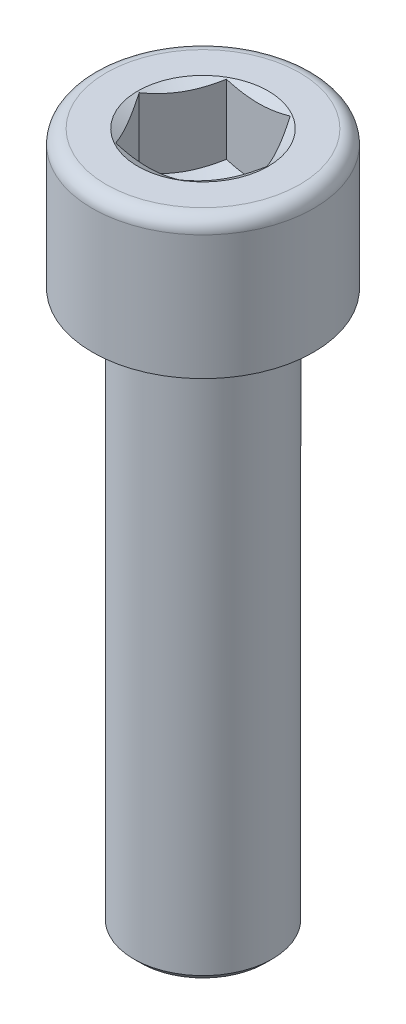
ISO-10303-21;
HEADER;
FILE_DESCRIPTION(('STEP AP214'),'2;1');
FILE_NAME('part.step','',(''),(''),'','','');
FILE_SCHEMA(('AUTOMOTIVE_DESIGN { 1 0 10303 214 1 1 1 1 }'));
ENDSEC;
DATA;
#1=APPLICATION_CONTEXT('core data for automotive mechanical design processes');
#2=APPLICATION_PROTOCOL_DEFINITION('international standard','automotive_design',2000,#1);
#3=PRODUCT_CONTEXT('',#1,'mechanical');
#4=PRODUCT('Part','Part','',(#3));
#5=PRODUCT_RELATED_PRODUCT_CATEGORY('part','',(#4));
#6=PRODUCT_DEFINITION_FORMATION('','',#4);
#7=PRODUCT_DEFINITION_CONTEXT('part definition',#1,'design');
#8=PRODUCT_DEFINITION('design','',#6,#7);
#9=PRODUCT_DEFINITION_SHAPE('','',#8);
#10=(LENGTH_UNIT() NAMED_UNIT(*) SI_UNIT(.MILLI.,.METRE.));
#11=(NAMED_UNIT(*) PLANE_ANGLE_UNIT() SI_UNIT($,.RADIAN.));
#12=(NAMED_UNIT(*) SI_UNIT($,.STERADIAN.) SOLID_ANGLE_UNIT());
#13=UNCERTAINTY_MEASURE_WITH_UNIT(LENGTH_MEASURE(1.E-05),#10,'distance_accuracy_value','');
#14=(GEOMETRIC_REPRESENTATION_CONTEXT(3) GLOBAL_UNCERTAINTY_ASSIGNED_CONTEXT((#13)) GLOBAL_UNIT_ASSIGNED_CONTEXT((#10,
#11,#12)) REPRESENTATION_CONTEXT('',''));
#15=CARTESIAN_POINT('',(0.,0.,0.));
#16=DIRECTION('',(0.,0.,1.));
#17=DIRECTION('',(1.,0.,0.));
#18=AXIS2_PLACEMENT_3D('',#15,#16,#17);
#19=CARTESIAN_POINT('',(0.,10.,0.));
#20=DIRECTION('',(0.,1.,0.));
#21=DIRECTION('',(0.,0.,1.));
#22=AXIS2_PLACEMENT_3D('',#19,#20,#21);
#23=PLANE('',#22);
#24=CARTESIAN_POINT('',(0.,10.,0.));
#25=DIRECTION('',(0.,1.,0.));
#26=DIRECTION('',(0.,0.,1.));
#27=AXIS2_PLACEMENT_3D('',#24,#25,#26);
#28=CIRCLE('',#27,7.);
#29=CARTESIAN_POINT('',(0.,10.,7.));
#30=VERTEX_POINT('',#29);
#31=EDGE_CURVE('E41',#30,#30,#28,.T.);
#32=ORIENTED_EDGE('',*,*,#31,.T.);
#33=EDGE_LOOP('',(#32));
#34=FACE_BOUND('',#33,.T.);
#35=CARTESIAN_POINT('',(0.,10.,0.));
#36=DIRECTION('',(0.,-1.,0.));
#37=DIRECTION('',(0.,0.,-1.));
#38=AXIS2_PLACEMENT_3D('',#35,#36,#37);
#39=CIRCLE('',#38,4.71880215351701);
#40=CARTESIAN_POINT('',(0.,10.,-4.71880215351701));
#41=VERTEX_POINT('',#40);
#42=EDGE_CURVE('E387',#41,#41,#39,.T.);
#43=ORIENTED_EDGE('',*,*,#42,.T.);
#44=EDGE_LOOP('',(#43));
#45=FACE_BOUND('',#44,.T.);
#46=ADVANCED_FACE('F33',(#34,#45),#23,.T.);
#47=CARTESIAN_POINT('',(0.,0.,0.));
#48=DIRECTION('',(0.,1.,0.));
#49=DIRECTION('',(0.,0.,1.));
#50=AXIS2_PLACEMENT_3D('',#47,#48,#49);
#51=PLANE('',#50);
#52=CARTESIAN_POINT('',(0.,0.,0.));
#53=DIRECTION('',(0.,1.,0.));
#54=DIRECTION('',(0.,0.,1.));
#55=AXIS2_PLACEMENT_3D('',#52,#53,#54);
#56=CIRCLE('',#55,5.4);
#57=CARTESIAN_POINT('',(0.,0.,5.4));
#58=VERTEX_POINT('',#57);
#59=EDGE_CURVE('E256',#58,#58,#56,.T.);
#60=ORIENTED_EDGE('',*,*,#59,.T.);
#61=EDGE_LOOP('',(#60));
#62=FACE_BOUND('',#61,.T.);
#63=CARTESIAN_POINT('',(0.,0.,0.));
#64=DIRECTION('',(0.,1.,0.));
#65=DIRECTION('',(0.,0.,1.));
#66=AXIS2_PLACEMENT_3D('',#63,#64,#65);
#67=CIRCLE('',#66,8.);
#68=CARTESIAN_POINT('',(0.,0.,8.));
#69=VERTEX_POINT('',#68);
#70=EDGE_CURVE('E127',#69,#69,#67,.T.);
#71=ORIENTED_EDGE('',*,*,#70,.F.);
#72=EDGE_LOOP('',(#71));
#73=FACE_BOUND('',#72,.T.);
#74=ADVANCED_FACE('F229',(#62,#73),#51,.F.);
#75=CARTESIAN_POINT('',(0.,10.,0.));
#76=DIRECTION('',(0.,-1.,0.));
#77=DIRECTION('',(0.,0.,-1.));
#78=AXIS2_PLACEMENT_3D('',#75,#76,#77);
#79=CYLINDRICAL_SURFACE('',#78,8.);
#80=CARTESIAN_POINT('',(0.,9.,0.));
#81=DIRECTION('',(0.,1.,0.));
#82=DIRECTION('',(0.,0.,1.));
#83=AXIS2_PLACEMENT_3D('',#80,#81,#82);
#84=CIRCLE('',#83,8.);
#85=CARTESIAN_POINT('',(0.,9.00000000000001,8.));
#86=VERTEX_POINT('',#85);
#87=EDGE_CURVE('E11',#86,#86,#84,.F.);
#88=ORIENTED_EDGE('',*,*,#87,.T.);
#89=EDGE_LOOP('',(#88));
#90=FACE_BOUND('',#89,.T.);
#91=ORIENTED_EDGE('',*,*,#70,.T.);
#92=EDGE_LOOP('',(#91));
#93=FACE_BOUND('',#92,.T.);
#94=ADVANCED_FACE('F35',(#90,#93),#79,.T.);
#95=CARTESIAN_POINT('',(0.,-40.,0.));
#96=DIRECTION('',(0.,1.,0.));
#97=DIRECTION('',(0.,0.,1.));
#98=AXIS2_PLACEMENT_3D('',#95,#96,#97);
#99=CYLINDRICAL_SURFACE('',#98,5.);
#100=CARTESIAN_POINT('',(0.,-0.399999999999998,0.));
#101=DIRECTION('',(0.,1.,0.));
#102=DIRECTION('',(0.,0.,1.));
#103=AXIS2_PLACEMENT_3D('',#100,#101,#102);
#104=CIRCLE('',#103,5.);
#105=CARTESIAN_POINT('',(0.,-0.399999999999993,5.));
#106=VERTEX_POINT('',#105);
#107=EDGE_CURVE('E250',#106,#106,#104,.F.);
#108=ORIENTED_EDGE('',*,*,#107,.T.);
#109=EDGE_LOOP('',(#108));
#110=FACE_BOUND('',#109,.T.);
#111=CARTESIAN_POINT('',(0.,-39.5,0.));
#112=DIRECTION('',(0.,-1.,0.));
#113=DIRECTION('',(0.,0.,-1.));
#114=AXIS2_PLACEMENT_3D('',#111,#112,#113);
#115=CIRCLE('',#114,5.);
#116=CARTESIAN_POINT('',(0.,-39.5,-5.));
#117=VERTEX_POINT('',#116);
#118=EDGE_CURVE('E253',#117,#117,#115,.F.);
#119=ORIENTED_EDGE('',*,*,#118,.T.);
#120=EDGE_LOOP('',(#119));
#121=FACE_BOUND('',#120,.T.);
#122=ADVANCED_FACE('F238',(#110,#121),#99,.T.);
#123=CARTESIAN_POINT('',(0.,-40.,0.));
#124=DIRECTION('',(0.,-1.,0.));
#125=DIRECTION('',(0.,0.,-1.));
#126=AXIS2_PLACEMENT_3D('',#123,#124,#125);
#127=PLANE('',#126);
#128=CARTESIAN_POINT('',(0.,-40.,0.));
#129=DIRECTION('',(0.,-1.,0.));
#130=DIRECTION('',(0.,0.,-1.));
#131=AXIS2_PLACEMENT_3D('',#128,#129,#130);
#132=CIRCLE('',#131,4.5);
#133=CARTESIAN_POINT('',(0.,-40.,-4.5));
#134=VERTEX_POINT('',#133);
#135=EDGE_CURVE('E96',#134,#134,#132,.T.);
#136=ORIENTED_EDGE('',*,*,#135,.T.);
#137=EDGE_LOOP('',(#136));
#138=FACE_BOUND('',#137,.T.);
#139=ADVANCED_FACE('F148',(#138),#127,.T.);
#140=CARTESIAN_POINT('',(0.,9.42264973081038,0.));
#141=DIRECTION('',(0.,1.,0.));
#142=DIRECTION('',(0.,0.,1.));
#143=AXIS2_PLACEMENT_3D('',#140,#141,#142);
#144=CONICAL_SURFACE('',#143,3.71880215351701,1.0471975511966);
#145=CARTESIAN_POINT('',(-2.30928560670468,9.94233164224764,4.00019999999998));
#146=CARTESIAN_POINT('',(-2.41077174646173,9.88371725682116,3.82442084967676));
#147=CARTESIAN_POINT('',(-2.51313390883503,9.83040970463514,3.64712438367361));
#148=CARTESIAN_POINT('',(-2.71963072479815,9.73736105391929,3.28946140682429));
#149=CARTESIAN_POINT('',(-2.82376904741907,9.69765287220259,3.10908854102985));
#150=CARTESIAN_POINT('',(-3.03075510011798,9.63584159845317,2.75057818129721));
#151=CARTESIAN_POINT('',(-3.13357098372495,9.61332711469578,2.57249584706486));
#152=CARTESIAN_POINT('',(-3.3396865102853,9.58645000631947,2.21549328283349));
#153=CARTESIAN_POINT('',(-3.44298540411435,9.58206512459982,2.03657435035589));
#154=CARTESIAN_POINT('',(-3.63600352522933,9.59118945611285,1.70225715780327));
#155=CARTESIAN_POINT('',(-3.72575165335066,9.60245833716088,1.54680884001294));
#156=CARTESIAN_POINT('',(-3.90466320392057,9.63817337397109,1.23692494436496));
#157=CARTESIAN_POINT('',(-3.99382600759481,9.66263172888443,1.08249043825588));
#158=CARTESIAN_POINT('',(-4.17310641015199,9.72377544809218,0.771967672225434));
#159=CARTESIAN_POINT('',(-4.26320131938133,9.76071998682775,0.615918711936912));
#160=CARTESIAN_POINT('',(-4.44204742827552,9.84456945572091,0.306148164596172));
#161=CARTESIAN_POINT('',(-4.53080091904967,9.89145468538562,0.152422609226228));
#162=CARTESIAN_POINT('',(-4.61891762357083,9.94233164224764,-0.000200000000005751));
#163=B_SPLINE_CURVE_WITH_KNOTS('',3,(#145,#146,#147,#148,#149,#150,#151,#152,#153,#154,#155,
#156,#157,#158,#159,#160,#161,#162),.UNSPECIFIED.,.F.,.F.,(4,2,2,2,2,2,2,2,4),(0.,
0.63404783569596,1.26961969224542,1.88946157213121,2.50854226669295,3.04757825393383,
3.58711366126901,4.13861653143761,4.6890364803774),.UNSPECIFIED.);
#164=CARTESIAN_POINT('',(-2.3094010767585,9.94226497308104,4.));
#165=VERTEX_POINT('',#164);
#166=CARTESIAN_POINT('',(-4.61880215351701,9.94226497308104,0.));
#167=VERTEX_POINT('',#166);
#168=EDGE_CURVE('E92',#165,#167,#163,.T.);
#169=ORIENTED_EDGE('',*,*,#168,.T.);
#170=CARTESIAN_POINT('',(-4.61891762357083,9.94233164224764,0.000199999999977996));
#171=CARTESIAN_POINT('',(-4.51743148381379,9.88371725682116,-0.175579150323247));
#172=CARTESIAN_POINT('',(-4.4150693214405,9.83040970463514,-0.352875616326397));
#173=CARTESIAN_POINT('',(-4.20857250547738,9.73736105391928,-0.710538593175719));
#174=CARTESIAN_POINT('',(-4.10443418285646,9.69765287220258,-0.890911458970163));
#175=CARTESIAN_POINT('',(-3.89744813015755,9.63584159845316,-1.2494218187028));
#176=CARTESIAN_POINT('',(-3.79463224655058,9.61332711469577,-1.42750415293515));
#177=CARTESIAN_POINT('',(-3.58851671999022,9.58645000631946,-1.78450671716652));
#178=CARTESIAN_POINT('',(-3.48521782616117,9.58206512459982,-1.96342564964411));
#179=CARTESIAN_POINT('',(-3.29219970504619,9.59118945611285,-2.29774284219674));
#180=CARTESIAN_POINT('',(-3.20245157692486,9.60245833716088,-2.45319115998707));
#181=CARTESIAN_POINT('',(-3.02354002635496,9.63817337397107,-2.76307505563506));
#182=CARTESIAN_POINT('',(-2.93437722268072,9.66263172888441,-2.91750956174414));
#183=CARTESIAN_POINT('',(-2.75509682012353,9.72377544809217,-3.22803232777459));
#184=CARTESIAN_POINT('',(-2.66500191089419,9.76071998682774,-3.38408128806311));
#185=CARTESIAN_POINT('',(-2.486155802,9.84456945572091,-3.69385183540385));
#186=CARTESIAN_POINT('',(-2.39740231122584,9.89145468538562,-3.84757739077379));
#187=CARTESIAN_POINT('',(-2.30928560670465,9.94233164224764,-4.00020000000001));
#188=B_SPLINE_CURVE_WITH_KNOTS('',3,(#170,#171,#172,#173,#174,#175,#176,#177,#178,#179,#180,
#181,#182,#183,#184,#185,#186,#187),.UNSPECIFIED.,.F.,.F.,(4,2,2,2,2,2,2,2,4),(0.,
0.634047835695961,1.26961969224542,1.88946157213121,2.50854226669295,3.04757825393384,
3.58711366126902,4.13861653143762,4.68903648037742),.UNSPECIFIED.);
#189=CARTESIAN_POINT('',(-2.3094010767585,9.94226497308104,-4.));
#190=VERTEX_POINT('',#189);
#191=EDGE_CURVE('E104',#167,#190,#188,.T.);
#192=ORIENTED_EDGE('',*,*,#191,.T.);
#193=CARTESIAN_POINT('',(-6.11037370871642,11.4921002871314,-4.));
#194=CARTESIAN_POINT('',(-5.93641897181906,11.4080948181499,-4.));
#195=CARTESIAN_POINT('',(-5.76205475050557,11.3249222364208,-3.99999999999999));
#196=CARTESIAN_POINT('',(-5.41228919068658,11.1607132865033,-3.99999999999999));
#197=CARTESIAN_POINT('',(-5.23688768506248,11.0796772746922,-3.99999999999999));
#198=CARTESIAN_POINT('',(-4.8838802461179,10.919784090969,-3.99999999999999));
#199=CARTESIAN_POINT('',(-4.70626744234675,10.8409420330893,-3.99999999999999));
#200=CARTESIAN_POINT('',(-4.34959610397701,10.6866114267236,-3.99999999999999));
#201=CARTESIAN_POINT('',(-4.17053764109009,10.6111227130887,-3.99999999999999));
#202=CARTESIAN_POINT('',(-3.80529412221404,10.4621869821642,-3.99999999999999));
#203=CARTESIAN_POINT('',(-3.61905622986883,10.3888688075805,-3.99999999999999));
#204=CARTESIAN_POINT('',(-3.24436751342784,10.2480100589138,-3.99999999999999));
#205=CARTESIAN_POINT('',(-3.05591643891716,10.1804701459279,-3.99999999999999));
#206=CARTESIAN_POINT('',(-2.67688546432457,10.0530093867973,-3.99999999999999));
#207=CARTESIAN_POINT('',(-2.48631109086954,9.99307227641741,-3.99999999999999));
#208=CARTESIAN_POINT('',(-2.10243118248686,9.88280134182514,-3.99999999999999));
#209=CARTESIAN_POINT('',(-1.90912655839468,9.83246439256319,-4.));
#210=CARTESIAN_POINT('',(-1.52072422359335,9.7441302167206,-4.));
#211=CARTESIAN_POINT('',(-1.32564108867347,9.70607010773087,-3.99999999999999));
#212=CARTESIAN_POINT('',(-0.933149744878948,9.644506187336,-3.99999999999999));
#213=CARTESIAN_POINT('',(-0.735741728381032,9.62100118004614,-3.99999999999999));
#214=CARTESIAN_POINT('',(-0.342124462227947,9.59073146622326,-3.99999999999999));
#215=CARTESIAN_POINT('',(-0.14593159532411,9.58375893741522,-3.99999999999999));
#216=CARTESIAN_POINT('',(0.24634543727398,9.58660365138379,-3.99999999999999));
#217=CARTESIAN_POINT('',(0.442429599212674,9.59642144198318,-4.00000000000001));
#218=CARTESIAN_POINT('',(0.778146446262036,9.62692429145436,-4.));
#219=CARTESIAN_POINT('',(0.918146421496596,9.64377659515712,-3.99999999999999));
#220=CARTESIAN_POINT('',(1.19705339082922,9.68493925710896,-3.99999999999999));
#221=CARTESIAN_POINT('',(1.33596022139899,9.70925071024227,-3.99999999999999));
#222=CARTESIAN_POINT('',(1.75089409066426,9.79208855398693,-3.99999999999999));
#223=CARTESIAN_POINT('',(2.02496577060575,9.86050113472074,-3.99999999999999));
#224=CARTESIAN_POINT('',(2.43467510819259,9.97826440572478,-3.99999999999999));
#225=CARTESIAN_POINT('',(2.57245705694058,10.0205724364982,-3.99999999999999));
#226=CARTESIAN_POINT('',(2.846681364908,10.1093654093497,-3.99999999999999));
#227=CARTESIAN_POINT('',(2.98312371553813,10.1558503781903,-3.99999999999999));
#228=CARTESIAN_POINT('',(3.25471647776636,10.2522694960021,-3.99999999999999));
#229=CARTESIAN_POINT('',(3.38986734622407,10.3022023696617,-3.99999999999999));
#230=CARTESIAN_POINT('',(3.65906404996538,10.404951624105,-3.99999999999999));
#231=CARTESIAN_POINT('',(3.79310989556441,10.4577679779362,-4.));
#232=CARTESIAN_POINT('',(4.09791687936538,10.5810469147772,-4.00000000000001));
#233=CARTESIAN_POINT('',(4.2683644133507,10.6522832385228,-3.99999999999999));
#234=CARTESIAN_POINT('',(4.60791209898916,10.7979056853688,-3.99999999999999));
#235=CARTESIAN_POINT('',(4.77701218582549,10.8722919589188,-3.99999999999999));
#236=CARTESIAN_POINT('',(5.11410011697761,11.0236102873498,-3.99999999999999));
#237=CARTESIAN_POINT('',(5.28208777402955,11.1005427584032,-3.99999999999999));
#238=CARTESIAN_POINT('',(5.61710376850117,11.2564716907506,-3.99999999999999));
#239=CARTESIAN_POINT('',(5.78413208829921,11.3354681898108,-3.99999999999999));
#240=CARTESIAN_POINT('',(6.28429184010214,11.5751145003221,-3.99999999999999));
#241=CARTESIAN_POINT('',(6.61621205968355,11.7382911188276,-3.99999999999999));
#242=CARTESIAN_POINT('',(7.27773008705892,12.0692839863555,-3.99999999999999));
#243=CARTESIAN_POINT('',(7.60732781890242,12.2371003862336,-3.99999999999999));
#244=CARTESIAN_POINT('',(8.23916412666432,12.5628549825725,-3.99999999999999));
#245=CARTESIAN_POINT('',(8.54153191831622,12.7205430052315,-3.99999999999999));
#246=CARTESIAN_POINT('',(9.1451452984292,13.0380700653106,-3.99999999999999));
#247=CARTESIAN_POINT('',(9.44639085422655,13.1979091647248,-3.99999999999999));
#248=CARTESIAN_POINT('',(10.0473455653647,13.5188914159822,-3.99999999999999));
#249=CARTESIAN_POINT('',(10.3470566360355,13.6800309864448,-4.));
#250=CARTESIAN_POINT('',(10.9457543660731,14.0036165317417,-3.99999999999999));
#251=CARTESIAN_POINT('',(11.2447410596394,14.1660624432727,-3.99999999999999));
#252=CARTESIAN_POINT('',(11.5434577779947,14.3289997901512,-3.99999999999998));
#253=B_SPLINE_CURVE_WITH_KNOTS('',3,(#193,#194,#195,#196,#197,#198,#199,#200,#201,#202,#203,
#204,#205,#206,#207,#208,#209,#210,#211,#212,#213,#214,#215,#216,#217,#218,#219,#220,#221,#222,
#223,#224,#225,#226,#227,#228,#229,#230,#231,#232,#233,#234,#235,#236,#237,#238,#239,#240,#241,
#242,#243,#244,#245,#246,#247,#248,#249,#250,#251,#252),.UNSPECIFIED.,.F.,.F.,(4,2,2,2,2,2,2,2,
2,2,2,2,2,2,2,2,2,2,2,2,2,2,2,2,2,2,2,2,2,4),(0.,0.579537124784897,1.15917031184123,
1.74211894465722,2.32503883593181,2.92541543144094,3.52586062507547,4.12499884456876,
4.72394169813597,5.31976614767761,5.91554163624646,6.50378725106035,7.09205205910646,
7.51487695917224,7.93776395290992,8.78404451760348,9.2164047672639,9.64876778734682,
10.0809717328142,10.5131716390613,11.0673347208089,11.6215243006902,12.1758049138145,
12.7300956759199,13.839619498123,14.9491794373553,15.9722155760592,16.9952812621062,
18.0161274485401,19.0369244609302),.UNSPECIFIED.);
#254=CARTESIAN_POINT('',(2.3094010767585,9.94226497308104,-4.));
#255=VERTEX_POINT('',#254);
#256=EDGE_CURVE('E187',#190,#255,#253,.T.);
#257=ORIENTED_EDGE('',*,*,#256,.T.);
#258=CARTESIAN_POINT('',(2.30928560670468,9.94233164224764,-4.00019999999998));
#259=CARTESIAN_POINT('',(2.41077174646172,9.88371725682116,-3.82442084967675));
#260=CARTESIAN_POINT('',(2.513133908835,9.83040970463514,-3.6471243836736));
#261=CARTESIAN_POINT('',(2.71963072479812,9.73736105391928,-3.28946140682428));
#262=CARTESIAN_POINT('',(2.82376904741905,9.69765287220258,-3.10908854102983));
#263=CARTESIAN_POINT('',(3.03075510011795,9.63584159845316,-2.7505781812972));
#264=CARTESIAN_POINT('',(3.13357098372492,9.61332711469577,-2.57249584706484));
#265=CARTESIAN_POINT('',(3.33968651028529,9.58645000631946,-2.21549328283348));
#266=CARTESIAN_POINT('',(3.44298540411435,9.58206512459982,-2.0365743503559));
#267=CARTESIAN_POINT('',(3.63600352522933,9.59118945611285,-1.70225715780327));
#268=CARTESIAN_POINT('',(3.72575165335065,9.60245833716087,-1.54680884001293));
#269=CARTESIAN_POINT('',(3.90466320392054,9.63817337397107,-1.23692494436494));
#270=CARTESIAN_POINT('',(3.99382600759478,9.66263172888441,-1.08249043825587));
#271=CARTESIAN_POINT('',(4.17310641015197,9.72377544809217,-0.771967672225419));
#272=CARTESIAN_POINT('',(4.26320131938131,9.76071998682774,-0.615918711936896));
#273=CARTESIAN_POINT('',(4.4420474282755,9.8445694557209,-0.306148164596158));
#274=CARTESIAN_POINT('',(4.53080091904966,9.89145468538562,-0.152422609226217));
#275=CARTESIAN_POINT('',(4.61891762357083,9.94233164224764,0.000200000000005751));
#276=B_SPLINE_CURVE_WITH_KNOTS('',3,(#258,#259,#260,#261,#262,#263,#264,#265,#266,#267,#268,
#269,#270,#271,#272,#273,#274,#275),.UNSPECIFIED.,.F.,.F.,(4,2,2,2,2,2,2,2,4),(0.,
0.634047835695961,1.26961969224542,1.88946157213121,2.50854226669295,3.04757825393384,
3.58711366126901,4.13861653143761,4.68903648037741),.UNSPECIFIED.);
#277=CARTESIAN_POINT('',(4.61880215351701,9.94226497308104,0.));
#278=VERTEX_POINT('',#277);
#279=EDGE_CURVE('E211',#255,#278,#276,.T.);
#280=ORIENTED_EDGE('',*,*,#279,.T.);
#281=CARTESIAN_POINT('',(4.61891762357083,9.94233164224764,-0.000199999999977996));
#282=CARTESIAN_POINT('',(4.5174314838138,9.88371725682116,0.175579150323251));
#283=CARTESIAN_POINT('',(4.41506932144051,9.83040970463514,0.352875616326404));
#284=CARTESIAN_POINT('',(4.20857250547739,9.73736105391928,0.710538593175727));
#285=CARTESIAN_POINT('',(4.10443418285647,9.69765287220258,0.89091145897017));
#286=CARTESIAN_POINT('',(3.89744813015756,9.63584159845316,1.24942181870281));
#287=CARTESIAN_POINT('',(3.7946322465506,9.61332711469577,1.42750415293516));
#288=CARTESIAN_POINT('',(3.58851671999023,9.58645000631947,1.78450671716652));
#289=CARTESIAN_POINT('',(3.48521782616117,9.58206512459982,1.96342564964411));
#290=CARTESIAN_POINT('',(3.29219970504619,9.59118945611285,2.29774284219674));
#291=CARTESIAN_POINT('',(3.20245157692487,9.60245833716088,2.45319115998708));
#292=CARTESIAN_POINT('',(3.02354002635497,9.63817337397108,2.76307505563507));
#293=CARTESIAN_POINT('',(2.93437722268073,9.66263172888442,2.91750956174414));
#294=CARTESIAN_POINT('',(2.75509682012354,9.72377544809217,3.22803232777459));
#295=CARTESIAN_POINT('',(2.6650019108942,9.76071998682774,3.38408128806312));
#296=CARTESIAN_POINT('',(2.48615580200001,9.84456945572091,3.69385183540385));
#297=CARTESIAN_POINT('',(2.39740231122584,9.89145468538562,3.84757739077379));
#298=CARTESIAN_POINT('',(2.30928560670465,9.94233164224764,4.00020000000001));
#299=B_SPLINE_CURVE_WITH_KNOTS('',3,(#281,#282,#283,#284,#285,#286,#287,#288,#289,#290,#291,
#292,#293,#294,#295,#296,#297,#298),.UNSPECIFIED.,.F.,.F.,(4,2,2,2,2,2,2,2,4),(0.,
0.634047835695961,1.26961969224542,1.88946157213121,2.50854226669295,3.04757825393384,
3.58711366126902,4.13861653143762,4.68903648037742),.UNSPECIFIED.);
#300=CARTESIAN_POINT('',(2.3094010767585,9.94226497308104,4.));
#301=VERTEX_POINT('',#300);
#302=EDGE_CURVE('E48',#278,#301,#299,.T.);
#303=ORIENTED_EDGE('',*,*,#302,.T.);
#304=CARTESIAN_POINT('',(-6.11037370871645,11.4921002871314,4.));
#305=CARTESIAN_POINT('',(-5.93641897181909,11.4080948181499,4.00000000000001));
#306=CARTESIAN_POINT('',(-5.76205475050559,11.3249222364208,4.00000000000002));
#307=CARTESIAN_POINT('',(-5.4122891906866,11.1607132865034,4.00000000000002));
#308=CARTESIAN_POINT('',(-5.23688768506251,11.0796772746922,4.00000000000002));
#309=CARTESIAN_POINT('',(-4.88388024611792,10.919784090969,4.00000000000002));
#310=CARTESIAN_POINT('',(-4.70626744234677,10.8409420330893,4.00000000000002));
#311=CARTESIAN_POINT('',(-4.34959610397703,10.6866114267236,4.00000000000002));
#312=CARTESIAN_POINT('',(-4.17053764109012,10.6111227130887,4.00000000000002));
#313=CARTESIAN_POINT('',(-3.80529412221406,10.4621869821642,4.00000000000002));
#314=CARTESIAN_POINT('',(-3.61905622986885,10.3888688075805,4.00000000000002));
#315=CARTESIAN_POINT('',(-3.24436751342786,10.2480100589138,4.00000000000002));
#316=CARTESIAN_POINT('',(-3.05591643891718,10.1804701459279,4.00000000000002));
#317=CARTESIAN_POINT('',(-2.67688546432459,10.0530093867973,4.00000000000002));
#318=CARTESIAN_POINT('',(-2.48631109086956,9.99307227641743,4.00000000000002));
#319=CARTESIAN_POINT('',(-2.10243118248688,9.88280134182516,4.00000000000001));
#320=CARTESIAN_POINT('',(-1.90912655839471,9.83246439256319,4.));
#321=CARTESIAN_POINT('',(-1.52072422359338,9.7441302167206,4.));
#322=CARTESIAN_POINT('',(-1.3256410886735,9.70607010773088,4.00000000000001));
#323=CARTESIAN_POINT('',(-0.933149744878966,9.64450618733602,4.00000000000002));
#324=CARTESIAN_POINT('',(-0.735741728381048,9.62100118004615,4.00000000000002));
#325=CARTESIAN_POINT('',(-0.342124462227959,9.59073146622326,4.00000000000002));
#326=CARTESIAN_POINT('',(-0.145931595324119,9.58375893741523,4.00000000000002));
#327=CARTESIAN_POINT('',(0.246345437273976,9.5866036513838,4.00000000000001));
#328=CARTESIAN_POINT('',(0.442429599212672,9.59642144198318,4.));
#329=CARTESIAN_POINT('',(0.778146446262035,9.62692429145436,4.00000000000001));
#330=CARTESIAN_POINT('',(0.918146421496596,9.64377659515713,4.00000000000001));
#331=CARTESIAN_POINT('',(1.19705339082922,9.68493925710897,4.00000000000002));
#332=CARTESIAN_POINT('',(1.33596022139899,9.70925071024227,4.00000000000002));
#333=CARTESIAN_POINT('',(1.75089409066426,9.79208855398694,4.00000000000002));
#334=CARTESIAN_POINT('',(2.02496577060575,9.86050113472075,4.00000000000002));
#335=CARTESIAN_POINT('',(2.43467510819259,9.97826440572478,4.00000000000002));
#336=CARTESIAN_POINT('',(2.57245705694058,10.0205724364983,4.00000000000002));
#337=CARTESIAN_POINT('',(2.846681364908,10.1093654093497,4.00000000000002));
#338=CARTESIAN_POINT('',(2.98312371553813,10.1558503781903,4.00000000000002));
#339=CARTESIAN_POINT('',(3.25471647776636,10.2522694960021,4.00000000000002));
#340=CARTESIAN_POINT('',(3.38986734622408,10.3022023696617,4.00000000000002));
#341=CARTESIAN_POINT('',(3.65906404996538,10.404951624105,4.00000000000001));
#342=CARTESIAN_POINT('',(3.79310989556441,10.4577679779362,4.));
#343=CARTESIAN_POINT('',(4.09791687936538,10.5810469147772,4.));
#344=CARTESIAN_POINT('',(4.2683644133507,10.6522832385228,4.00000000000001));
#345=CARTESIAN_POINT('',(4.60791209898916,10.7979056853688,4.00000000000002));
#346=CARTESIAN_POINT('',(4.77701218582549,10.8722919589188,4.00000000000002));
#347=CARTESIAN_POINT('',(5.11410011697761,11.0236102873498,4.00000000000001));
#348=CARTESIAN_POINT('',(5.28208777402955,11.1005427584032,4.00000000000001));
#349=CARTESIAN_POINT('',(5.61710376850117,11.2564716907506,4.00000000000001));
#350=CARTESIAN_POINT('',(5.78413208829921,11.3354681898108,4.00000000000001));
#351=CARTESIAN_POINT('',(6.28429184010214,11.5751145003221,4.00000000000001));
#352=CARTESIAN_POINT('',(6.61621205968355,11.7382911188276,4.00000000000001));
#353=CARTESIAN_POINT('',(7.27773008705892,12.0692839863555,4.00000000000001));
#354=CARTESIAN_POINT('',(7.60732781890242,12.2371003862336,4.00000000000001));
#355=CARTESIAN_POINT('',(8.23916412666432,12.5628549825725,4.00000000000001));
#356=CARTESIAN_POINT('',(8.54153191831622,12.7205430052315,4.00000000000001));
#357=CARTESIAN_POINT('',(9.1451452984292,13.0380700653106,4.00000000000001));
#358=CARTESIAN_POINT('',(9.44639085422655,13.1979091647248,4.00000000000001));
#359=CARTESIAN_POINT('',(10.0473455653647,13.5188914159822,4.00000000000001));
#360=CARTESIAN_POINT('',(10.3470566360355,13.6800309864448,4.00000000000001));
#361=CARTESIAN_POINT('',(10.9457543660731,14.0036165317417,4.00000000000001));
#362=CARTESIAN_POINT('',(11.2447410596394,14.1660624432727,4.00000000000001));
#363=CARTESIAN_POINT('',(11.5434577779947,14.3289997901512,4.));
#364=B_SPLINE_CURVE_WITH_KNOTS('',3,(#304,#305,#306,#307,#308,#309,#310,#311,#312,#313,#314,
#315,#316,#317,#318,#319,#320,#321,#322,#323,#324,#325,#326,#327,#328,#329,#330,#331,#332,#333,
#334,#335,#336,#337,#338,#339,#340,#341,#342,#343,#344,#345,#346,#347,#348,#349,#350,#351,#352,
#353,#354,#355,#356,#357,#358,#359,#360,#361,#362,#363),.UNSPECIFIED.,.F.,.F.,(4,2,2,2,2,2,2,2,
2,2,2,2,2,2,2,2,2,2,2,2,2,2,2,2,2,2,2,2,2,4),(0.,0.579537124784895,1.15917031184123,
1.74211894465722,2.32503883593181,2.92541543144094,3.52586062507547,4.12499884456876,
4.72394169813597,5.31976614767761,5.91554163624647,6.50378725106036,7.09205205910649,
7.51487695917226,7.93776395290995,8.7840445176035,9.21640476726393,9.64876778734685,
10.0809717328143,10.5131716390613,11.0673347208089,11.6215243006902,12.1758049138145,
12.73009567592,13.839619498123,14.9491794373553,15.9722155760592,16.9952812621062,
18.0161274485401,19.0369244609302),.UNSPECIFIED.);
#365=EDGE_CURVE('E88',#301,#165,#364,.F.);
#366=ORIENTED_EDGE('',*,*,#365,.T.);
#367=EDGE_LOOP('',(#169,#192,#257,#280,#303,#366));
#368=FACE_BOUND('',#367,.T.);
#369=ORIENTED_EDGE('',*,*,#42,.F.);
#370=EDGE_LOOP('',(#369));
#371=FACE_BOUND('',#370,.T.);
#372=ADVANCED_FACE('F90',(#368,#371),#144,.F.);
#373=CARTESIAN_POINT('',(0.,2.25758622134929,0.));
#374=DIRECTION('',(0.,1.,0.));
#375=DIRECTION('',(0.,0.,1.));
#376=AXIS2_PLACEMENT_3D('',#373,#374,#375);
#377=CONICAL_SURFACE('',#376,0.,1.0471975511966);
#378=CARTESIAN_POINT('',(-2.30928560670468,4.92431955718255,4.00019999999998));
#379=CARTESIAN_POINT('',(-2.41077174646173,4.86570517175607,3.82442084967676));
#380=CARTESIAN_POINT('',(-2.51313390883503,4.81239761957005,3.64712438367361));
#381=CARTESIAN_POINT('',(-2.71963072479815,4.71934896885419,3.28946140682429));
#382=CARTESIAN_POINT('',(-2.82376904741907,4.67964078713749,3.10908854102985));
#383=CARTESIAN_POINT('',(-3.03075510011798,4.61782951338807,2.75057818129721));
#384=CARTESIAN_POINT('',(-3.13357098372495,4.59531502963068,2.57249584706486));
#385=CARTESIAN_POINT('',(-3.33968651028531,4.56843792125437,2.21549328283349));
#386=CARTESIAN_POINT('',(-3.44298540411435,4.56405303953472,2.03657435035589));
#387=CARTESIAN_POINT('',(-3.63600352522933,4.57317737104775,1.70225715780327));
#388=CARTESIAN_POINT('',(-3.72575165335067,4.58444625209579,1.54680884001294));
#389=CARTESIAN_POINT('',(-3.90466320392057,4.62016128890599,1.23692494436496));
#390=CARTESIAN_POINT('',(-3.99382600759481,4.64461964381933,1.08249043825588));
#391=CARTESIAN_POINT('',(-4.17310641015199,4.70576336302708,0.771967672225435));
#392=CARTESIAN_POINT('',(-4.26320131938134,4.74270790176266,0.615918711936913));
#393=CARTESIAN_POINT('',(-4.44204742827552,4.82655737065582,0.306148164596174));
#394=CARTESIAN_POINT('',(-4.53080091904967,4.87344260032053,0.152422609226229));
#395=CARTESIAN_POINT('',(-4.61891762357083,4.92431955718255,-0.000200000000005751));
#396=B_SPLINE_CURVE_WITH_KNOTS('',3,(#378,#379,#380,#381,#382,#383,#384,#385,#386,#387,#388,
#389,#390,#391,#392,#393,#394,#395),.UNSPECIFIED.,.F.,.F.,(4,2,2,2,2,2,2,2,4),(0.,
0.63404783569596,1.26961969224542,1.88946157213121,2.50854226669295,3.04757825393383,
3.58711366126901,4.13861653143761,4.6890364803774),.UNSPECIFIED.);
#397=CARTESIAN_POINT('',(-2.3094010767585,4.92425288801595,4.));
#398=VERTEX_POINT('',#397);
#399=CARTESIAN_POINT('',(-4.61880215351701,4.92425288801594,0.));
#400=VERTEX_POINT('',#399);
#401=EDGE_CURVE('E97',#398,#400,#396,.T.);
#402=ORIENTED_EDGE('',*,*,#401,.F.);
#403=CARTESIAN_POINT('',(-6.00605969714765,6.42382965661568,4.));
#404=CARTESIAN_POINT('',(-5.83283395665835,6.34061344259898,4.00000000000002));
#405=CARTESIAN_POINT('',(-5.65918847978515,6.25825478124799,4.00000000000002));
#406=CARTESIAN_POINT('',(-5.31083383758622,6.0957396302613,4.00000000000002));
#407=CARTESIAN_POINT('',(-5.13612448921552,6.01558353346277,4.00000000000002));
#408=CARTESIAN_POINT('',(-4.78441964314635,5.85751424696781,4.00000000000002));
#409=CARTESIAN_POINT('',(-4.60741671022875,5.77961753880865,4.00000000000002));
#410=CARTESIAN_POINT('',(-4.25193104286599,5.62729011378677,4.00000000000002));
#411=CARTESIAN_POINT('',(-4.07344838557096,5.55285921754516,4.00000000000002));
#412=CARTESIAN_POINT('',(-3.70992772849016,5.40645608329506,4.00000000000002));
#413=CARTESIAN_POINT('',(-3.52484177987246,5.33460220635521,4.00000000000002));
#414=CARTESIAN_POINT('',(-3.15243345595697,5.19682611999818,4.00000000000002));
#415=CARTESIAN_POINT('',(-2.96511082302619,5.13090460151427,4.00000000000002));
#416=CARTESIAN_POINT('',(-2.5883501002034,5.00686890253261,4.00000000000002));
#417=CARTESIAN_POINT('',(-2.39891788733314,4.94873706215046,4.00000000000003));
#418=CARTESIAN_POINT('',(-2.01734735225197,4.84227334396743,4.00000000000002));
#419=CARTESIAN_POINT('',(-1.82520996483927,4.79393816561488,4.));
#420=CARTESIAN_POINT('',(-1.43906936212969,4.70973834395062,4.));
#421=CARTESIAN_POINT('',(-1.24507832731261,4.67381891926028,4.00000000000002));
#422=CARTESIAN_POINT('',(-0.854906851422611,4.61663493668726,4.00000000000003));
#423=CARTESIAN_POINT('',(-0.658726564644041,4.59536935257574,4.00000000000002));
#424=CARTESIAN_POINT('',(-0.267625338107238,4.56946692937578,4.00000000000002));
#425=CARTESIAN_POINT('',(-0.0727178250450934,4.56463226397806,4.00000000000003));
#426=CARTESIAN_POINT('',(0.316818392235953,4.57149192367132,4.00000000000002));
#427=CARTESIAN_POINT('',(0.511447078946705,4.58318724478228,4.));
#428=CARTESIAN_POINT('',(0.847945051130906,4.61690682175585,4.00000000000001));
#429=CARTESIAN_POINT('',(0.990186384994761,4.63539189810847,4.00000000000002));
#430=CARTESIAN_POINT('',(1.27348832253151,4.67992718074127,4.00000000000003));
#431=CARTESIAN_POINT('',(1.41454873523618,4.705978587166,4.00000000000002));
#432=CARTESIAN_POINT('',(1.83584293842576,4.79409750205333,4.00000000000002));
#433=CARTESIAN_POINT('',(2.11401239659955,4.86610973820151,4.00000000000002));
#434=CARTESIAN_POINT('',(2.52994142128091,4.9892542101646,4.00000000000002));
#435=CARTESIAN_POINT('',(2.66989142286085,5.03339450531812,4.00000000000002));
#436=CARTESIAN_POINT('',(2.94843018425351,5.12581720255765,4.00000000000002));
#437=CARTESIAN_POINT('',(3.0870189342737,5.17409963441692,4.00000000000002));
#438=CARTESIAN_POINT('',(3.36289000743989,5.27406882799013,4.00000000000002));
#439=CARTESIAN_POINT('',(3.5001728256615,5.32575423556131,4.00000000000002));
#440=CARTESIAN_POINT('',(3.77362939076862,5.43196572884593,4.00000000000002));
#441=CARTESIAN_POINT('',(3.90980315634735,5.48649176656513,4.00000000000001));
#442=CARTESIAN_POINT('',(4.25901975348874,5.62985816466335,4.));
#443=CARTESIAN_POINT('',(4.47134686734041,5.72043968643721,4.00000000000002));
#444=CARTESIAN_POINT('',(4.89406987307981,5.9060155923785,4.00000000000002));
#445=CARTESIAN_POINT('',(5.1044656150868,6.00101031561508,4.00000000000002));
#446=CARTESIAN_POINT('',(5.52374059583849,6.19441314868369,4.00000000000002));
#447=CARTESIAN_POINT('',(5.73261944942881,6.29282209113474,4.00000000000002));
#448=CARTESIAN_POINT('',(6.14911191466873,6.49228667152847,4.00000000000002));
#449=CARTESIAN_POINT('',(6.3567254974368,6.59334236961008,4.00000000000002));
#450=CARTESIAN_POINT('',(6.77116766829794,6.79766954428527,4.00000000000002));
#451=CARTESIAN_POINT('',(6.97799501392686,6.90094353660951,4.00000000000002));
#452=CARTESIAN_POINT('',(7.39079913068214,7.10917923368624,4.00000000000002));
#453=CARTESIAN_POINT('',(7.59677589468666,7.21414095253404,4.00000000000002));
#454=CARTESIAN_POINT('',(8.21359205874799,7.53103203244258,4.00000000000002));
#455=CARTESIAN_POINT('',(8.62338364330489,7.74500028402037,4.00000000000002));
#456=CARTESIAN_POINT('',(9.40205080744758,8.15606984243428,4.00000000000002));
#457=CARTESIAN_POINT('',(9.77110431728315,8.35283554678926,4.00000000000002));
#458=CARTESIAN_POINT('',(10.5080248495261,8.74861354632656,4.00000000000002));
#459=CARTESIAN_POINT('',(10.875891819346,8.94762593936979,4.00000000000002));
#460=CARTESIAN_POINT('',(11.6097595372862,9.34681253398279,4.00000000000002));
#461=CARTESIAN_POINT('',(11.9757626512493,9.54698239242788,4.00000000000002));
#462=CARTESIAN_POINT('',(12.7070267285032,9.94862274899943,4.00000000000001));
#463=CARTESIAN_POINT('',(13.0722877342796,10.1500931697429,4.00000000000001));
#464=CARTESIAN_POINT('',(13.4372832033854,10.3520406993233,4.));
#465=B_SPLINE_CURVE_WITH_KNOTS('',3,(#403,#404,#405,#406,#407,#408,#409,#410,#411,#412,#413,
#414,#415,#416,#417,#418,#419,#420,#421,#422,#423,#424,#425,#426,#427,#428,#429,#430,#431,#432,
#433,#434,#435,#436,#437,#438,#439,#440,#441,#442,#443,#444,#445,#446,#447,#448,#449,#450,#451,
#452,#453,#454,#455,#456,#457,#458,#459,#460,#461,#462,#463,#464),.UNSPECIFIED.,.F.,.F.,(4,2,2,
2,2,2,2,2,2,2,2,2,2,2,2,2,2,2,2,2,2,2,2,2,2,2,2,2,2,2,4),(0.,0.576539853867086,1.15318187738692,
1.73330864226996,2.31340534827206,2.90895940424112,3.50458273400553,4.09883202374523,
4.69288077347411,5.28427393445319,5.87562567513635,6.45983189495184,7.04407331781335,
7.47417329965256,7.90434153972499,8.76521090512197,9.20541722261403,9.64562670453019,
10.08566206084,10.5256899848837,11.2181419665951,11.9106472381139,12.6033225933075,
13.2960137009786,13.9895368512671,14.683065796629,16.0699015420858,17.3245867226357,
18.5793267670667,19.830817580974,21.0822346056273),.UNSPECIFIED.);
#466=CARTESIAN_POINT('',(2.3094010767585,4.92425288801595,4.));
#467=VERTEX_POINT('',#466);
#468=EDGE_CURVE('E109',#467,#398,#465,.F.);
#469=ORIENTED_EDGE('',*,*,#468,.F.);
#470=CARTESIAN_POINT('',(4.61891762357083,4.92431955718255,-0.000199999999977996));
#471=CARTESIAN_POINT('',(4.5174314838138,4.86570517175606,0.175579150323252));
#472=CARTESIAN_POINT('',(4.41506932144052,4.81239761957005,0.352875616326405));
#473=CARTESIAN_POINT('',(4.2085725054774,4.71934896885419,0.710538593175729));
#474=CARTESIAN_POINT('',(4.10443418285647,4.67964078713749,0.890911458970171));
#475=CARTESIAN_POINT('',(3.89744813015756,4.61782951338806,1.24942181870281));
#476=CARTESIAN_POINT('',(3.7946322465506,4.59531502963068,1.42750415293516));
#477=CARTESIAN_POINT('',(3.58851671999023,4.56843792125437,1.78450671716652));
#478=CARTESIAN_POINT('',(3.48521782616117,4.56405303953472,1.96342564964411));
#479=CARTESIAN_POINT('',(3.29219970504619,4.57317737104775,2.29774284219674));
#480=CARTESIAN_POINT('',(3.20245157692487,4.58444625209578,2.45319115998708));
#481=CARTESIAN_POINT('',(3.02354002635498,4.62016128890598,2.76307505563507));
#482=CARTESIAN_POINT('',(2.93437722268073,4.64461964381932,2.91750956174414));
#483=CARTESIAN_POINT('',(2.75509682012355,4.70576336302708,3.22803232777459));
#484=CARTESIAN_POINT('',(2.66500191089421,4.74270790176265,3.38408128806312));
#485=CARTESIAN_POINT('',(2.48615580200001,4.82655737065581,3.69385183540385));
#486=CARTESIAN_POINT('',(2.39740231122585,4.87344260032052,3.84757739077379));
#487=CARTESIAN_POINT('',(2.30928560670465,4.92431955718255,4.00020000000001));
#488=B_SPLINE_CURVE_WITH_KNOTS('',3,(#470,#471,#472,#473,#474,#475,#476,#477,#478,#479,#480,
#481,#482,#483,#484,#485,#486,#487),.UNSPECIFIED.,.F.,.F.,(4,2,2,2,2,2,2,2,4),(0.,
0.63404783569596,1.26961969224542,1.88946157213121,2.50854226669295,3.04757825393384,
3.58711366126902,4.13861653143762,4.68903648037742),.UNSPECIFIED.);
#489=CARTESIAN_POINT('',(4.61880215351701,4.92425288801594,0.));
#490=VERTEX_POINT('',#489);
#491=EDGE_CURVE('E136',#490,#467,#488,.T.);
#492=ORIENTED_EDGE('',*,*,#491,.F.);
#493=CARTESIAN_POINT('',(2.30928560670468,4.92431955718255,-4.00019999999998));
#494=CARTESIAN_POINT('',(2.41077174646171,4.86570517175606,-3.82442084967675));
#495=CARTESIAN_POINT('',(2.513133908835,4.81239761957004,-3.6471243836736));
#496=CARTESIAN_POINT('',(2.71963072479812,4.71934896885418,-3.28946140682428));
#497=CARTESIAN_POINT('',(2.82376904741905,4.67964078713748,-3.10908854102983));
#498=CARTESIAN_POINT('',(3.03075510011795,4.61782951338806,-2.7505781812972));
#499=CARTESIAN_POINT('',(3.13357098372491,4.59531502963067,-2.57249584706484));
#500=CARTESIAN_POINT('',(3.33968651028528,4.56843792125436,-2.21549328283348));
#501=CARTESIAN_POINT('',(3.44298540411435,4.56405303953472,-2.0365743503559));
#502=CARTESIAN_POINT('',(3.63600352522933,4.57317737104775,-1.70225715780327));
#503=CARTESIAN_POINT('',(3.72575165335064,4.58444625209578,-1.54680884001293));
#504=CARTESIAN_POINT('',(3.90466320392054,4.62016128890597,-1.23692494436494));
#505=CARTESIAN_POINT('',(3.99382600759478,4.64461964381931,-1.08249043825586));
#506=CARTESIAN_POINT('',(4.17310641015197,4.70576336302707,-0.771967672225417));
#507=CARTESIAN_POINT('',(4.26320131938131,4.74270790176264,-0.615918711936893));
#508=CARTESIAN_POINT('',(4.4420474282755,4.82655737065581,-0.306148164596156));
#509=CARTESIAN_POINT('',(4.53080091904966,4.87344260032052,-0.152422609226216));
#510=CARTESIAN_POINT('',(4.61891762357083,4.92431955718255,0.000200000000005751));
#511=B_SPLINE_CURVE_WITH_KNOTS('',3,(#493,#494,#495,#496,#497,#498,#499,#500,#501,#502,#503,
#504,#505,#506,#507,#508,#509,#510),.UNSPECIFIED.,.F.,.F.,(4,2,2,2,2,2,2,2,4),(0.,
0.634047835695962,1.26961969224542,1.88946157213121,2.50854226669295,3.04757825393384,
3.58711366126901,4.13861653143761,4.68903648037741),.UNSPECIFIED.);
#512=CARTESIAN_POINT('',(2.3094010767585,4.92425288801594,-4.));
#513=VERTEX_POINT('',#512);
#514=EDGE_CURVE('E156',#513,#490,#511,.T.);
#515=ORIENTED_EDGE('',*,*,#514,.F.);
#516=CARTESIAN_POINT('',(-6.00605969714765,6.42382965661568,-4.));
#517=CARTESIAN_POINT('',(-5.83283395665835,6.34061344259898,-3.99999999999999));
#518=CARTESIAN_POINT('',(-5.65918847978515,6.25825478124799,-3.99999999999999));
#519=CARTESIAN_POINT('',(-5.31083383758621,6.0957396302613,-3.99999999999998));
#520=CARTESIAN_POINT('',(-5.13612448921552,6.01558353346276,-3.99999999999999));
#521=CARTESIAN_POINT('',(-4.78441964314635,5.85751424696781,-3.99999999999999));
#522=CARTESIAN_POINT('',(-4.60741671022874,5.77961753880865,-3.99999999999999));
#523=CARTESIAN_POINT('',(-4.25193104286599,5.62729011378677,-3.99999999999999));
#524=CARTESIAN_POINT('',(-4.07344838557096,5.55285921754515,-3.99999999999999));
#525=CARTESIAN_POINT('',(-3.70992772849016,5.40645608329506,-3.99999999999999));
#526=CARTESIAN_POINT('',(-3.52484177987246,5.33460220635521,-3.99999999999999));
#527=CARTESIAN_POINT('',(-3.15243345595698,5.19682611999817,-3.99999999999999));
#528=CARTESIAN_POINT('',(-2.96511082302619,5.13090460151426,-3.99999999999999));
#529=CARTESIAN_POINT('',(-2.5883501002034,5.0068689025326,-3.99999999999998));
#530=CARTESIAN_POINT('',(-2.39891788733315,4.94873706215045,-3.99999999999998));
#531=CARTESIAN_POINT('',(-2.01734735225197,4.84227334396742,-3.99999999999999));
#532=CARTESIAN_POINT('',(-1.82520996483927,4.79393816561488,-4.));
#533=CARTESIAN_POINT('',(-1.43906936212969,4.70973834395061,-4.));
#534=CARTESIAN_POINT('',(-1.24507832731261,4.67381891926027,-3.99999999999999));
#535=CARTESIAN_POINT('',(-0.854906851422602,4.61663493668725,-3.99999999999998));
#536=CARTESIAN_POINT('',(-0.658726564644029,4.59536935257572,-3.99999999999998));
#537=CARTESIAN_POINT('',(-0.267625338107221,4.56946692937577,-3.99999999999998));
#538=CARTESIAN_POINT('',(-0.0727178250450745,4.56463226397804,-3.99999999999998));
#539=CARTESIAN_POINT('',(0.316818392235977,4.57149192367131,-3.99999999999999));
#540=CARTESIAN_POINT('',(0.511447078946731,4.58318724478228,-4.00000000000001));
#541=CARTESIAN_POINT('',(0.847945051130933,4.61690682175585,-4.));
#542=CARTESIAN_POINT('',(0.990186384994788,4.63539189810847,-3.99999999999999));
#543=CARTESIAN_POINT('',(1.27348832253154,4.67992718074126,-3.99999999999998));
#544=CARTESIAN_POINT('',(1.41454873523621,4.705978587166,-3.99999999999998));
#545=CARTESIAN_POINT('',(1.83584293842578,4.79409750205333,-3.99999999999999));
#546=CARTESIAN_POINT('',(2.11401239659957,4.86610973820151,-3.99999999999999));
#547=CARTESIAN_POINT('',(2.52994142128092,4.9892542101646,-3.99999999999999));
#548=CARTESIAN_POINT('',(2.66989142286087,5.03339450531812,-3.99999999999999));
#549=CARTESIAN_POINT('',(2.94843018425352,5.12581720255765,-3.99999999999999));
#550=CARTESIAN_POINT('',(3.08701893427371,5.17409963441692,-3.99999999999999));
#551=CARTESIAN_POINT('',(3.3628900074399,5.27406882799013,-3.99999999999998));
#552=CARTESIAN_POINT('',(3.50017282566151,5.32575423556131,-3.99999999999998));
#553=CARTESIAN_POINT('',(3.77362939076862,5.43196572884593,-3.99999999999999));
#554=CARTESIAN_POINT('',(3.90980315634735,5.48649176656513,-4.));
#555=CARTESIAN_POINT('',(4.25901975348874,5.62985816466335,-4.00000000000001));
#556=CARTESIAN_POINT('',(4.47134686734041,5.72043968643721,-3.99999999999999));
#557=CARTESIAN_POINT('',(4.89406987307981,5.90601559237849,-3.99999999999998));
#558=CARTESIAN_POINT('',(5.1044656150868,6.00101031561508,-3.99999999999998));
#559=CARTESIAN_POINT('',(5.52374059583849,6.19441314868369,-3.99999999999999));
#560=CARTESIAN_POINT('',(5.73261944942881,6.29282209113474,-3.99999999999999));
#561=CARTESIAN_POINT('',(6.14911191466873,6.49228667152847,-3.99999999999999));
#562=CARTESIAN_POINT('',(6.3567254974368,6.59334236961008,-3.99999999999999));
#563=CARTESIAN_POINT('',(6.77116766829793,6.79766954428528,-3.99999999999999));
#564=CARTESIAN_POINT('',(6.97799501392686,6.90094353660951,-3.99999999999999));
#565=CARTESIAN_POINT('',(7.39079913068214,7.10917923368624,-3.99999999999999));
#566=CARTESIAN_POINT('',(7.59677589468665,7.21414095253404,-3.99999999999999));
#567=CARTESIAN_POINT('',(8.21359205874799,7.53103203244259,-3.99999999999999));
#568=CARTESIAN_POINT('',(8.62338364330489,7.74500028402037,-3.99999999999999));
#569=CARTESIAN_POINT('',(9.40205080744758,8.15606984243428,-3.99999999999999));
#570=CARTESIAN_POINT('',(9.77110431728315,8.35283554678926,-3.99999999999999));
#571=CARTESIAN_POINT('',(10.5080248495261,8.74861354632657,-3.99999999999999));
#572=CARTESIAN_POINT('',(10.875891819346,8.9476259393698,-3.99999999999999));
#573=CARTESIAN_POINT('',(11.6097595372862,9.3468125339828,-3.99999999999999));
#574=CARTESIAN_POINT('',(11.9757626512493,9.54698239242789,-3.99999999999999));
#575=CARTESIAN_POINT('',(12.7070267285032,9.94862274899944,-3.99999999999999));
#576=CARTESIAN_POINT('',(13.0722877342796,10.1500931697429,-3.99999999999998));
#577=CARTESIAN_POINT('',(13.4372832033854,10.3520406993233,-3.99999999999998));
#578=B_SPLINE_CURVE_WITH_KNOTS('',3,(#516,#517,#518,#519,#520,#521,#522,#523,#524,#525,#526,
#527,#528,#529,#530,#531,#532,#533,#534,#535,#536,#537,#538,#539,#540,#541,#542,#543,#544,#545,
#546,#547,#548,#549,#550,#551,#552,#553,#554,#555,#556,#557,#558,#559,#560,#561,#562,#563,#564,
#565,#566,#567,#568,#569,#570,#571,#572,#573,#574,#575,#576,#577),.UNSPECIFIED.,.F.,.F.,(4,2,2,
2,2,2,2,2,2,2,2,2,2,2,2,2,2,2,2,2,2,2,2,2,2,2,2,2,2,2,4),(0.,0.576539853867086,1.15318187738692,
1.73330864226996,2.31340534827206,2.90895940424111,3.50458273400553,4.09883202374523,
4.69288077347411,5.2842739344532,5.87562567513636,6.45983189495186,7.04407331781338,
7.47417329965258,7.90434153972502,8.76521090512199,9.20541722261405,9.64562670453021,
10.08566206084,10.5256899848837,11.2181419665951,11.910647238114,12.6033225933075,
13.2960137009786,13.9895368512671,14.683065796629,16.0699015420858,17.3245867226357,
18.5793267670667,19.830817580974,21.0822346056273),.UNSPECIFIED.);
#579=CARTESIAN_POINT('',(-2.3094010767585,4.92425288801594,-4.));
#580=VERTEX_POINT('',#579);
#581=EDGE_CURVE('E162',#580,#513,#578,.T.);
#582=ORIENTED_EDGE('',*,*,#581,.F.);
#583=CARTESIAN_POINT('',(-4.61891762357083,4.92431955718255,0.000199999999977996));
#584=CARTESIAN_POINT('',(-4.51743148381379,4.86570517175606,-0.175579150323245));
#585=CARTESIAN_POINT('',(-4.4150693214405,4.81239761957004,-0.352875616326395));
#586=CARTESIAN_POINT('',(-4.20857250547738,4.71934896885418,-0.710538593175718));
#587=CARTESIAN_POINT('',(-4.10443418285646,4.67964078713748,-0.890911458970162));
#588=CARTESIAN_POINT('',(-3.89744813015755,4.61782951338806,-1.2494218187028));
#589=CARTESIAN_POINT('',(-3.79463224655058,4.59531502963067,-1.42750415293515));
#590=CARTESIAN_POINT('',(-3.58851671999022,4.56843792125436,-1.78450671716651));
#591=CARTESIAN_POINT('',(-3.48521782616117,4.56405303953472,-1.96342564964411));
#592=CARTESIAN_POINT('',(-3.29219970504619,4.57317737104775,-2.29774284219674));
#593=CARTESIAN_POINT('',(-3.20245157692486,4.58444625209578,-2.45319115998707));
#594=CARTESIAN_POINT('',(-3.02354002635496,4.62016128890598,-2.76307505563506));
#595=CARTESIAN_POINT('',(-2.93437722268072,4.64461964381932,-2.91750956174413));
#596=CARTESIAN_POINT('',(-2.75509682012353,4.70576336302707,-3.22803232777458));
#597=CARTESIAN_POINT('',(-2.66500191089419,4.74270790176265,-3.38408128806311));
#598=CARTESIAN_POINT('',(-2.48615580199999,4.82655737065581,-3.69385183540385));
#599=CARTESIAN_POINT('',(-2.39740231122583,4.87344260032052,-3.84757739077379));
#600=CARTESIAN_POINT('',(-2.30928560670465,4.92431955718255,-4.00020000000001));
#601=B_SPLINE_CURVE_WITH_KNOTS('',3,(#583,#584,#585,#586,#587,#588,#589,#590,#591,#592,#593,
#594,#595,#596,#597,#598,#599,#600),.UNSPECIFIED.,.F.,.F.,(4,2,2,2,2,2,2,2,4),(0.,
0.634047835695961,1.26961969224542,1.88946157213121,2.50854226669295,3.04757825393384,
3.58711366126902,4.13861653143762,4.68903648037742),.UNSPECIFIED.);
#602=EDGE_CURVE('E168',#400,#580,#601,.T.);
#603=ORIENTED_EDGE('',*,*,#602,.F.);
#604=EDGE_LOOP('',(#402,#469,#492,#515,#582,#603));
#605=FACE_BOUND('',#604,.T.);
#606=CARTESIAN_POINT('',(0.,2.25758622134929,0.));
#607=VERTEX_POINT('',#606);
#608=VERTEX_LOOP('',#607);
#609=FACE_BOUND('',#608,.T.);
#610=ADVANCED_FACE('F143',(#605,#609),#377,.F.);
#611=CARTESIAN_POINT('',(-2.3094010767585,23.4350288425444,4.));
#612=DIRECTION('',(0.,0.,-1.));
#613=DIRECTION('',(-1.,0.,0.));
#614=AXIS2_PLACEMENT_3D('',#611,#612,#613);
#615=PLANE('',#614);
#616=ORIENTED_EDGE('',*,*,#365,.F.);
#617=DIRECTION('',(0.,-1.,0.));
#618=VECTOR('',#617,1.);
#619=CARTESIAN_POINT('',(2.3094010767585,23.4350288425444,4.));
#620=LINE('',#619,#618);
#621=EDGE_CURVE('E125',#301,#467,#620,.T.);
#622=ORIENTED_EDGE('',*,*,#621,.T.);
#623=ORIENTED_EDGE('',*,*,#468,.T.);
#624=DIRECTION('',(0.,-1.,0.));
#625=VECTOR('',#624,1.);
#626=CARTESIAN_POINT('',(-2.3094010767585,23.4350288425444,4.));
#627=LINE('',#626,#625);
#628=EDGE_CURVE('E102',#165,#398,#627,.T.);
#629=ORIENTED_EDGE('',*,*,#628,.F.);
#630=EDGE_LOOP('',(#616,#622,#623,#629));
#631=FACE_BOUND('',#630,.T.);
#632=ADVANCED_FACE('F107',(#631),#615,.T.);
#633=CARTESIAN_POINT('',(2.3094010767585,23.4350288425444,4.));
#634=DIRECTION('',(-0.866025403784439,0.,-0.5));
#635=DIRECTION('',(-0.5,0.,0.866025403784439));
#636=AXIS2_PLACEMENT_3D('',#633,#634,#635);
#637=PLANE('',#636);
#638=ORIENTED_EDGE('',*,*,#302,.F.);
#639=DIRECTION('',(0.,-1.,0.));
#640=VECTOR('',#639,1.);
#641=CARTESIAN_POINT('',(4.61880215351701,23.4350288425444,0.));
#642=LINE('',#641,#640);
#643=EDGE_CURVE('E123',#278,#490,#642,.T.);
#644=ORIENTED_EDGE('',*,*,#643,.T.);
#645=ORIENTED_EDGE('',*,*,#491,.T.);
#646=ORIENTED_EDGE('',*,*,#621,.F.);
#647=EDGE_LOOP('',(#638,#644,#645,#646));
#648=FACE_BOUND('',#647,.T.);
#649=ADVANCED_FACE('F218',(#648),#637,.T.);
#650=CARTESIAN_POINT('',(4.61880215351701,23.4350288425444,0.));
#651=DIRECTION('',(-0.866025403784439,0.,0.5));
#652=DIRECTION('',(0.5,0.,0.866025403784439));
#653=AXIS2_PLACEMENT_3D('',#650,#651,#652);
#654=PLANE('',#653);
#655=ORIENTED_EDGE('',*,*,#279,.F.);
#656=DIRECTION('',(0.,-1.,0.));
#657=VECTOR('',#656,1.);
#658=CARTESIAN_POINT('',(2.3094010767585,23.4350288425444,-4.));
#659=LINE('',#658,#657);
#660=EDGE_CURVE('E121',#255,#513,#659,.T.);
#661=ORIENTED_EDGE('',*,*,#660,.T.);
#662=ORIENTED_EDGE('',*,*,#514,.T.);
#663=ORIENTED_EDGE('',*,*,#643,.F.);
#664=EDGE_LOOP('',(#655,#661,#662,#663));
#665=FACE_BOUND('',#664,.T.);
#666=ADVANCED_FACE('F215',(#665),#654,.T.);
#667=CARTESIAN_POINT('',(2.3094010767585,23.4350288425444,-4.));
#668=DIRECTION('',(0.,0.,1.));
#669=DIRECTION('',(1.,0.,0.));
#670=AXIS2_PLACEMENT_3D('',#667,#668,#669);
#671=PLANE('',#670);
#672=ORIENTED_EDGE('',*,*,#256,.F.);
#673=DIRECTION('',(0.,-1.,0.));
#674=VECTOR('',#673,1.);
#675=CARTESIAN_POINT('',(-2.3094010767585,23.4350288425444,-4.));
#676=LINE('',#675,#674);
#677=EDGE_CURVE('E111',#190,#580,#676,.T.);
#678=ORIENTED_EDGE('',*,*,#677,.T.);
#679=ORIENTED_EDGE('',*,*,#581,.T.);
#680=ORIENTED_EDGE('',*,*,#660,.F.);
#681=EDGE_LOOP('',(#672,#678,#679,#680));
#682=FACE_BOUND('',#681,.T.);
#683=ADVANCED_FACE('F179',(#682),#671,.T.);
#684=CARTESIAN_POINT('',(-2.3094010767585,23.4350288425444,-4.));
#685=DIRECTION('',(0.866025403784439,0.,0.5));
#686=DIRECTION('',(0.5,0.,-0.866025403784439));
#687=AXIS2_PLACEMENT_3D('',#684,#685,#686);
#688=PLANE('',#687);
#689=ORIENTED_EDGE('',*,*,#191,.F.);
#690=DIRECTION('',(0.,-1.,0.));
#691=VECTOR('',#690,1.);
#692=CARTESIAN_POINT('',(-4.61880215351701,23.4350288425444,0.));
#693=LINE('',#692,#691);
#694=EDGE_CURVE('E56',#167,#400,#693,.T.);
#695=ORIENTED_EDGE('',*,*,#694,.T.);
#696=ORIENTED_EDGE('',*,*,#602,.T.);
#697=ORIENTED_EDGE('',*,*,#677,.F.);
#698=EDGE_LOOP('',(#689,#695,#696,#697));
#699=FACE_BOUND('',#698,.T.);
#700=ADVANCED_FACE('F176',(#699),#688,.T.);
#701=CARTESIAN_POINT('',(-4.61880215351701,23.4350288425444,0.));
#702=DIRECTION('',(0.866025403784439,0.,-0.5));
#703=DIRECTION('',(-0.5,0.,-0.866025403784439));
#704=AXIS2_PLACEMENT_3D('',#701,#702,#703);
#705=PLANE('',#704);
#706=ORIENTED_EDGE('',*,*,#168,.F.);
#707=ORIENTED_EDGE('',*,*,#628,.T.);
#708=ORIENTED_EDGE('',*,*,#401,.T.);
#709=ORIENTED_EDGE('',*,*,#694,.F.);
#710=EDGE_LOOP('',(#706,#707,#708,#709));
#711=FACE_BOUND('',#710,.T.);
#712=ADVANCED_FACE('F100',(#711),#705,.T.);
#713=CARTESIAN_POINT('',(0.,-40.,0.));
#714=DIRECTION('',(0.,1.,0.));
#715=DIRECTION('',(0.,0.,1.));
#716=AXIS2_PLACEMENT_3D('',#713,#714,#715);
#717=CONICAL_SURFACE('',#716,4.5,0.785398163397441);
#718=ORIENTED_EDGE('',*,*,#118,.F.);
#719=EDGE_LOOP('',(#718));
#720=FACE_BOUND('',#719,.T.);
#721=ORIENTED_EDGE('',*,*,#135,.F.);
#722=EDGE_LOOP('',(#721));
#723=FACE_BOUND('',#722,.T.);
#724=ADVANCED_FACE('F195',(#720,#723),#717,.T.);
#725=CARTESIAN_POINT('',(0.,-0.399999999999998,0.));
#726=DIRECTION('',(0.,1.,0.));
#727=DIRECTION('',(0.,0.,1.));
#728=AXIS2_PLACEMENT_3D('',#725,#726,#727);
#729=TOROIDAL_SURFACE('',#728,5.4,0.4);
#730=ORIENTED_EDGE('',*,*,#59,.F.);
#731=EDGE_LOOP('',(#730));
#732=FACE_BOUND('',#731,.T.);
#733=ORIENTED_EDGE('',*,*,#107,.F.);
#734=EDGE_LOOP('',(#733));
#735=FACE_BOUND('',#734,.T.);
#736=ADVANCED_FACE('F265',(#732,#735),#729,.F.);
#737=CARTESIAN_POINT('',(0.,9.,0.));
#738=DIRECTION('',(0.,1.,0.));
#739=DIRECTION('',(0.,0.,1.));
#740=AXIS2_PLACEMENT_3D('',#737,#738,#739);
#741=TOROIDAL_SURFACE('',#740,7.,1.);
#742=ORIENTED_EDGE('',*,*,#87,.F.);
#743=EDGE_LOOP('',(#742));
#744=FACE_BOUND('',#743,.T.);
#745=ORIENTED_EDGE('',*,*,#31,.F.);
#746=EDGE_LOOP('',(#745));
#747=FACE_BOUND('',#746,.T.);
#748=ADVANCED_FACE('F263',(#744,#747),#741,.T.);
#749=CLOSED_SHELL('',(#46,#74,#94,#122,#139,#372,#610,#632,#649,#666,#683,#700,#712,#724,#736,#748));
#750=MANIFOLD_SOLID_BREP('B2',#749);
#751=ADVANCED_BREP_SHAPE_REPRESENTATION('',(#18,#750),#14);
#752=SHAPE_DEFINITION_REPRESENTATION(#9,#751);
ENDSEC;
END-ISO-10303-21;
